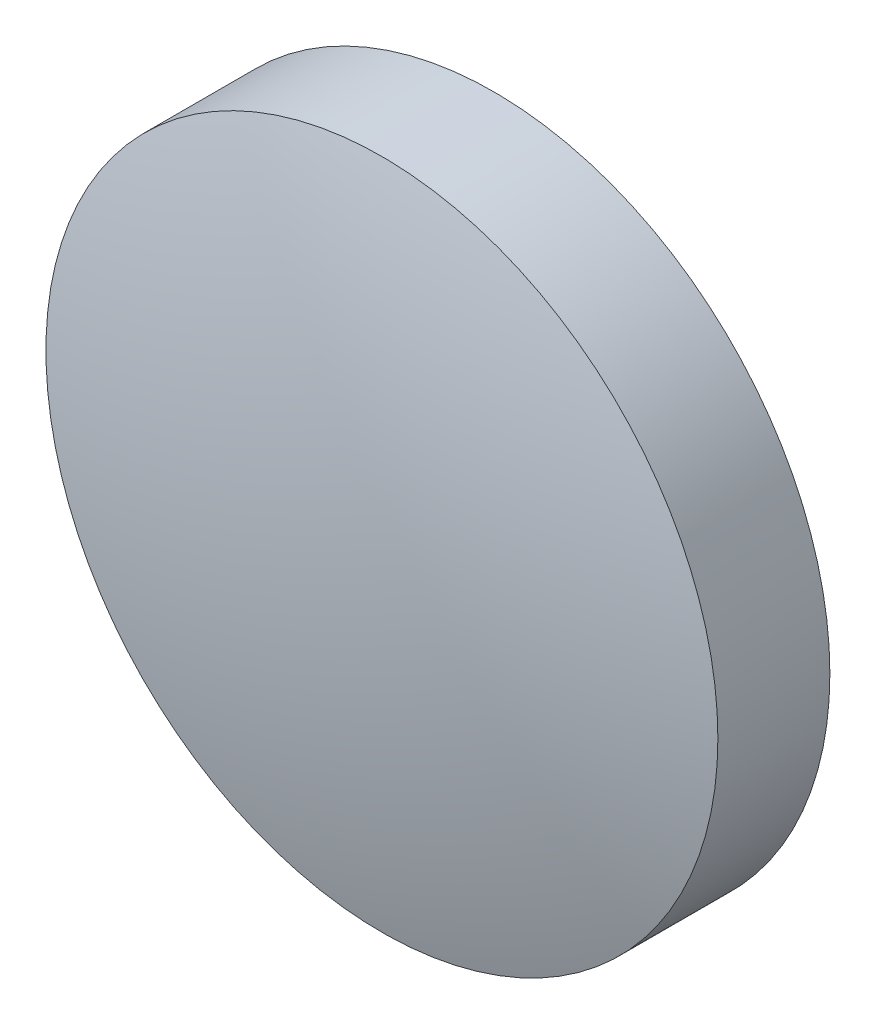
ISO-10303-21;
HEADER;
FILE_DESCRIPTION(('STEP AP214'),'2;1');
FILE_NAME('part.step','',(''),(''),'','','');
FILE_SCHEMA(('AUTOMOTIVE_DESIGN { 1 0 10303 214 1 1 1 1 }'));
ENDSEC;
DATA;
#1=APPLICATION_CONTEXT('core data for automotive mechanical design processes');
#2=APPLICATION_PROTOCOL_DEFINITION('international standard','automotive_design',2000,#1);
#3=PRODUCT_CONTEXT('',#1,'mechanical');
#4=PRODUCT('Part','Part','',(#3));
#5=PRODUCT_RELATED_PRODUCT_CATEGORY('part','',(#4));
#6=PRODUCT_DEFINITION_FORMATION('','',#4);
#7=PRODUCT_DEFINITION_CONTEXT('part definition',#1,'design');
#8=PRODUCT_DEFINITION('design','',#6,#7);
#9=PRODUCT_DEFINITION_SHAPE('','',#8);
#10=(LENGTH_UNIT() NAMED_UNIT(*) SI_UNIT(.MILLI.,.METRE.));
#11=(NAMED_UNIT(*) PLANE_ANGLE_UNIT() SI_UNIT($,.RADIAN.));
#12=(NAMED_UNIT(*) SI_UNIT($,.STERADIAN.) SOLID_ANGLE_UNIT());
#13=UNCERTAINTY_MEASURE_WITH_UNIT(LENGTH_MEASURE(1.E-05),#10,'distance_accuracy_value','');
#14=(GEOMETRIC_REPRESENTATION_CONTEXT(3) GLOBAL_UNCERTAINTY_ASSIGNED_CONTEXT((#13)) GLOBAL_UNIT_ASSIGNED_CONTEXT((#10,
#11,#12)) REPRESENTATION_CONTEXT('',''));
#15=CARTESIAN_POINT('',(0.,0.,0.));
#16=DIRECTION('',(0.,0.,1.));
#17=DIRECTION('',(1.,0.,0.));
#18=AXIS2_PLACEMENT_3D('',#15,#16,#17);
#19=CARTESIAN_POINT('',(0.,0.,5.));
#20=DIRECTION('',(0.,0.,-1.));
#21=DIRECTION('',(-1.,0.,0.));
#22=AXIS2_PLACEMENT_3D('',#19,#20,#21);
#23=CYLINDRICAL_SURFACE('',#22,15.);
#24=CARTESIAN_POINT('',(0.,0.,5.));
#25=DIRECTION('',(0.,0.,1.));
#26=DIRECTION('',(1.,0.,0.));
#27=AXIS2_PLACEMENT_3D('',#24,#25,#26);
#28=CIRCLE('',#27,15.);
#29=CARTESIAN_POINT('',(15.,0.,5.));
#30=VERTEX_POINT('',#29);
#31=EDGE_CURVE('E10',#30,#30,#28,.T.);
#32=ORIENTED_EDGE('',*,*,#31,.F.);
#33=EDGE_LOOP('',(#32));
#34=FACE_BOUND('',#33,.T.);
#35=CARTESIAN_POINT('',(0.,0.,0.));
#36=DIRECTION('',(0.,0.,1.));
#37=DIRECTION('',(1.,0.,0.));
#38=AXIS2_PLACEMENT_3D('',#35,#36,#37);
#39=CIRCLE('',#38,15.);
#40=CARTESIAN_POINT('',(15.,0.,0.));
#41=VERTEX_POINT('',#40);
#42=EDGE_CURVE('E35',#41,#41,#39,.T.);
#43=ORIENTED_EDGE('',*,*,#42,.T.);
#44=EDGE_LOOP('',(#43));
#45=FACE_BOUND('',#44,.T.);
#46=ADVANCED_FACE('F31',(#34,#45),#23,.T.);
#47=CARTESIAN_POINT('',(0.,0.,-50.25));
#48=DIRECTION('',(0.,0.,1.));
#49=DIRECTION('',(1.,0.,0.));
#50=AXIS2_PLACEMENT_3D('',#47,#48,#49);
#51=SPHERICAL_SURFACE('',#50,57.25);
#52=ORIENTED_EDGE('',*,*,#31,.T.);
#53=EDGE_LOOP('',(#52));
#54=FACE_BOUND('',#53,.T.);
#55=ADVANCED_FACE('F46',(#54),#51,.T.);
#56=CARTESIAN_POINT('',(0.,0.,-55.25));
#57=DIRECTION('',(0.,0.,1.));
#58=DIRECTION('',(1.,0.,0.));
#59=AXIS2_PLACEMENT_3D('',#56,#57,#58);
#60=SPHERICAL_SURFACE('',#59,57.25);
#61=ORIENTED_EDGE('',*,*,#42,.F.);
#62=EDGE_LOOP('',(#61));
#63=FACE_BOUND('',#62,.T.);
#64=ADVANCED_FACE('F33',(#63),#60,.F.);
#65=CLOSED_SHELL('',(#46,#55,#64));
#66=MANIFOLD_SOLID_BREP('B2',#65);
#67=ADVANCED_BREP_SHAPE_REPRESENTATION('',(#18,#66),#14);
#68=SHAPE_DEFINITION_REPRESENTATION(#9,#67);
ENDSEC;
END-ISO-10303-21;
